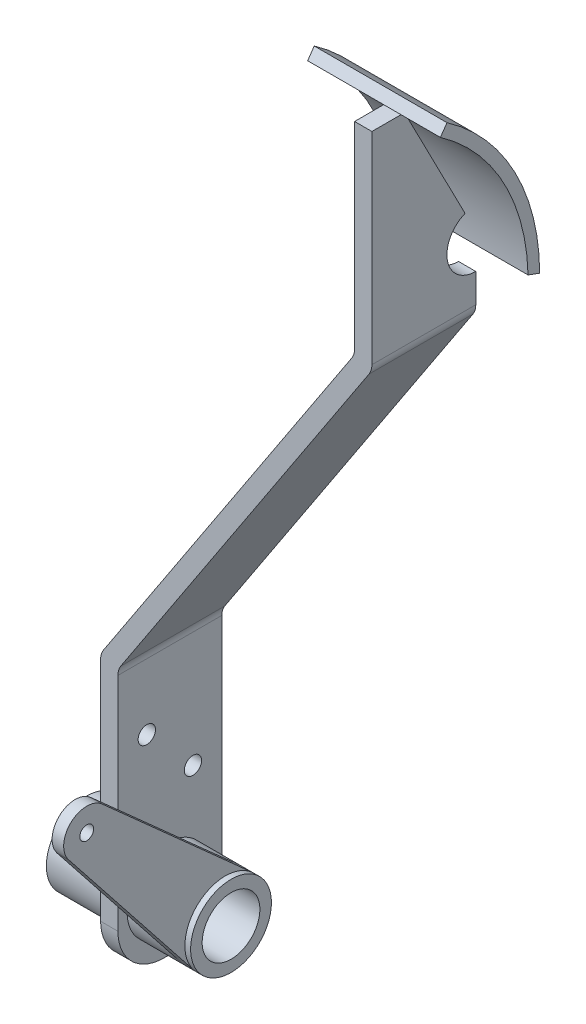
from build123d import *

# Parameters (mm, degrees)
EXTRU_MINCE1_DEPTH           = 18
CONG_1_R                     = 3
ENL_V_MAT_EXTRU_4_DEPTH      = 159.218203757
ENL_V_MAT_EXTRU_4_DEPTH_BACK = 159.218203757
ESQUISSE2_R                  = 5
ENL_V_MAT_EXTRU_1_DEPTH      = 159.218203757
EXTRUSION1_DEPTH             = 10
EXTRUSION1_DEPTH_BACK        = 13
ESQUISSE4_R                  = 7
ENL_V_MAT_EXTRU_2_DEPTH      = 165.950272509
CONG_2_R                     = 8
EXTRUSION2_DEPTH             = 11
EXTRUSION2_DEPTH_BACK        = 14
ESQUISSE5_R                  = 7
ESQUISSE5_R_2                = 5
ESQUISSE6_R                  = 1.2
EXTRUSION3_DEPTH             = 2
ESQUISSE7_R                  = 1.5
ENL_V_MAT_EXTRU_3_DEPTH      = 169.177419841
ESQUISSE9_R                  = 1.5
ENL_V_MAT_EXTRU_5_DEPTH      = 169.177419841


with BuildPart() as part:
    # Esquisse1 → Extru.-Mince1 (new body)
    with BuildSketch(Plane.XY):
        Polygon((0, 0), (0, 48.186827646), (44, 115), (44, 150), (47, 150), (47, 114.100898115), (3, 47.287725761), (3, 0), align=None)
    extrude(amount=EXTRU_MINCE1_DEPTH)

    # Cong_1
    cong_1_edges = [part.edges().sort_by_distance(p)[0] for p in [
        (47, 114.100898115, 9),
        (3, 47.287725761, 9),
        (0, 48.186827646, 9),
        (44, 115, 9),
    ]]
    fillet(cong_1_edges, radius=CONG_1_R)

    # Esquisse8 → Enl_v. mat.-Extru.4 (cut, two sides: drawn at the far end of the back side and taken through both)
    with BuildSketch(Plane(origin=(47, 0, 0), x_dir=(0, 0, -1), z_dir=(1, 0, 0)).offset(-ENL_V_MAT_EXTRU_4_DEPTH_BACK)):
        Polygon((-168.420831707, 452.495568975), (-17.072814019, 159.136579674), (8.284492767, 109.986323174), (159.632510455, -183.372666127), (746.350489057, 119.323369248), (418.297146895, 755.191604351), align=None)
    extrude(amount=ENL_V_MAT_EXTRU_4_DEPTH + ENL_V_MAT_EXTRU_4_DEPTH_BACK, mode=Mode.SUBTRACT)

    # Esquisse2 → Enl_v. mat.-Extru.1 (cut, through all)
    with BuildSketch(Plane(origin=(47, 0, 0), x_dir=(0, 0, -1), z_dir=(1, 0, 0))):
        with Locations((0, 125)):
            Circle(ESQUISSE2_R)
    extrude(amount=-ENL_V_MAT_EXTRU_1_DEPTH, mode=Mode.SUBTRACT)

    # Esquisse4 → Enl_v. mat.-Extru.2 (cut, through all)
    with BuildSketch(Plane(origin=(3, 0, 0), x_dir=(0, 0, -1), z_dir=(1, 0, 0))):
        with Locations((-9.403905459, 10)):
            Circle(ESQUISSE4_R)
    extrude(amount=-ENL_V_MAT_EXTRU_2_DEPTH, mode=Mode.SUBTRACT)

    # Cong_2
    cong_2_edges = [part.edges().sort_by_distance(p)[0] for p in [
        (1.5, 0, 18),
        (1.5, 0, 0),
    ]]
    fillet(cong_2_edges, radius=CONG_2_R)

    # Esquisse5 → Extrusion2 (add, two sides: drawn at the far end of the back side and taken through both)
    with BuildSketch(Plane(origin=(3, 0, 0), x_dir=(0, 0, -1), z_dir=(1, 0, 0)).offset(-EXTRUSION2_DEPTH_BACK)):
        with Locations((-9.403905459, 10)):
            Circle(ESQUISSE5_R)
        with Locations((-9.403905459, 10)):
            Circle(ESQUISSE5_R_2, mode=Mode.SUBTRACT)
    extrude(amount=EXTRUSION2_DEPTH + EXTRUSION2_DEPTH_BACK)

    # Esquisse6 → Extrusion3 (add)
    with BuildSketch(Plane(origin=(11, 0, 0), x_dir=(0, 0, -1), z_dir=(1, 0, 0))):
        with BuildLine():
            Line((-14.891678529, 5.654387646), (-36.539775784, 32.992271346))
            ThreePointArc((-36.539775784, 32.992271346), (-36.146762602, 38.386961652), (-30.738239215, 38.457796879))
            Line((-30.738239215, 38.457796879), (-4.738989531, 15.219057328))
            ThreePointArc((-4.738989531, 15.219057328), (-14.203905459, 15.095095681), (-14.891678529, 5.654387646))
        make_face()
        with Locations((-33.403905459, 35.475478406)):
            Circle(ESQUISSE6_R, mode=Mode.SUBTRACT)
    extrude(amount=EXTRUSION3_DEPTH)

    # Esquisse7 → Enl_v. mat.-Extru.3 (cut, through all)
    with BuildSketch(Plane(origin=(3, 0, 0), x_dir=(0, 0, -1), z_dir=(1, 0, 0))):
        with Locations((-13, 35)):
            Circle(ESQUISSE7_R)
    extrude(amount=-ENL_V_MAT_EXTRU_3_DEPTH, mode=Mode.SUBTRACT)

    # Esquisse9 → Enl_v. mat.-Extru.5 (cut, through all)
    with BuildSketch(Plane(origin=(3, 0, 0), x_dir=(0, 0, -1), z_dir=(1, 0, 0))):
        with Locations((-5, 26.388623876)):
            Circle(ESQUISSE9_R)
    extrude(amount=-ENL_V_MAT_EXTRU_5_DEPTH, mode=Mode.SUBTRACT)


with BuildPart() as body_2:
    # Esquisse3 → Extrusion1 (new, two sides: drawn at the far end of the back side and taken through both)
    with BuildSketch(Plane(origin=(47, 0, 0), x_dir=(0, 0, -1), z_dir=(1, 0, 0)).offset(-EXTRUSION1_DEPTH_BACK)):
        with BuildLine():
            Line((-16.13216989, 153.177217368), (-14.988468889, 154.817933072))
            ThreePointArc((-14.988468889, 154.817933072), (-3.221649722, 141.469028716), (1.066859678, 124.198824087))
            Line((1.066859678, 124.198824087), (-0.943862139, 124.938166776))
            ThreePointArc((-0.943862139, 124.938166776), (-5.168130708, 140.870177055), (-16.13216989, 153.177217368))
        make_face()
    extrude(amount=EXTRUSION1_DEPTH + EXTRUSION1_DEPTH_BACK)


solid = Compound([part.part, body_2.part])
